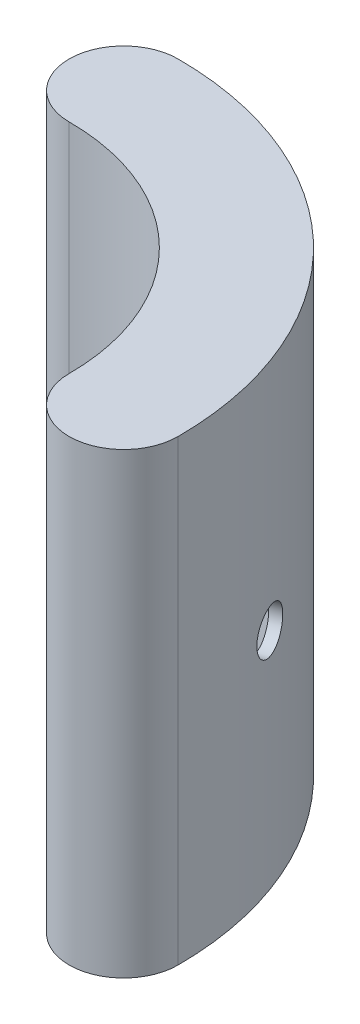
from build123d import *

# Parameters (mm, degrees)
EXTRUDE1_DEPTH     = 101.6
EXTRUDE6_DEPTH     = 2.54
EXTRUDE7_START     = 2.54
EXTRUDE7_DEPTH     = 2.54
SKETCH4_R          = 5.08
CUT_EXTRUDE1_DEPTH = 7.62
SKETCH5_R          = 3.175
CUT_EXTRUDE2_DEPTH = 7.62


with BuildPart() as part:
    # Sketch1 → Extrude1 (new body)
    with BuildSketch(Plane(origin=(0, 0, 0), x_dir=(1, 0, 0), z_dir=(0, 1, 0))):
        with BuildLine():
            ThreePointArc((0, 76.2), (53.881536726, 53.881536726), (76.2, 0))
            ThreePointArc((76.2, 0), (63.5, -12.7), (50.8, 0))
            ThreePointArc((50.8, 0), (35.921024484, 35.921024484), (0, 50.8))
            ThreePointArc((0, 50.8), (-12.7, 63.5), (0, 76.2))
        make_face()
        with BuildLine():
            ThreePointArc((0, 73.66), (52.085485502, 52.085485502), (73.66, 0))
            ThreePointArc((73.66, 0), (63.5, -10.16), (53.34, 0))
            ThreePointArc((53.34, 0), (37.717075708, 37.717075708), (0, 53.34))
            ThreePointArc((0, 53.34), (-10.16, 63.5), (0, 73.66))
        make_face(mode=Mode.SUBTRACT)
    extrude(amount=EXTRUDE1_DEPTH)

    # Sketch2 → Extrude6 (add)
    with BuildSketch(Plane(origin=(0, 101.6, 0), x_dir=(-1, 0, 0), z_dir=(0, 1, 0))):
        with BuildLine():
            ThreePointArc((-76.2, 0), (-53.881536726, -53.881536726), (0, -76.2))
            ThreePointArc((0, -76.2), (12.7, -63.5), (0, -50.8))
            ThreePointArc((0, -50.8), (-35.921024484, -35.921024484), (-50.8, 0))
            ThreePointArc((-50.8, 0), (-63.5, 12.7), (-76.2, 0))
        make_face()
    extrude(amount=EXTRUDE6_DEPTH)

    # Sketch3 → Extrude7 (add)
    with BuildSketch(Plane.XZ.offset(EXTRUDE7_START)):
        with BuildLine():
            ThreePointArc((0, -50.8), (35.921024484, -35.921024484), (50.8, 0))
            ThreePointArc((50.8, 0), (63.5, 12.7), (76.2, 0))
            ThreePointArc((76.2, 0), (53.881536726, -53.881536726), (0, -76.2))
            ThreePointArc((0, -76.2), (-12.7, -63.5), (0, -50.8))
        make_face()
    extrude(amount=-EXTRUDE7_DEPTH)

    # Sketch4 → Cut-Extrude1 (cut)
    with BuildSketch(Plane(origin=(73.765476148, 0, -27.070938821), x_dir=(-0.3445193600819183, 0, -0.9387792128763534), z_dir=(0.9387792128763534, 0, -0.3445193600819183))):
        with Locations((0, 49.53)):
            Circle(SKETCH4_R)
    extrude(amount=-CUT_EXTRUDE1_DEPTH, mode=Mode.SUBTRACT)

    # Sketch5 → Cut-Extrude2 (cut)
    with BuildSketch(Plane(origin=(26.213941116, 0, -74.074357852), x_dir=(-0.9427102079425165, 0, -0.333612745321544), z_dir=(0.333612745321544, 0, -0.9427102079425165))):
        with Locations((0, 49.53)):
            Circle(SKETCH5_R)
    extrude(amount=-CUT_EXTRUDE2_DEPTH, mode=Mode.SUBTRACT)


solid = part.part
